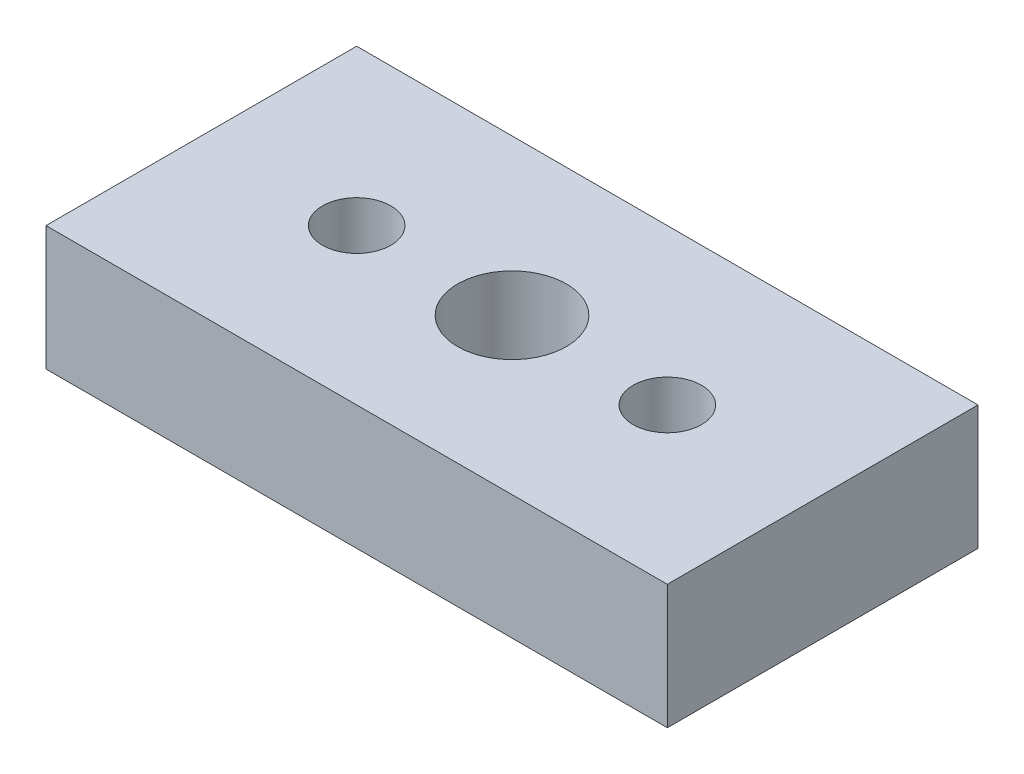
from build123d import *

# Parameters (mm, degrees)
SKETCH_1_W                = 60
SKETCH_1_H                = 30
EXTRUDE_1_DEPTH           = 12
M12X1_5_1_D               = 10.5
HOLE_WIZARD_1_D           = 6.6
HOLE_WIZARD_1_CBORE_D     = 11
HOLE_WIZARD_1_CBORE_DEPTH = 6.5


with BuildPart() as part:
    # Sketch 1 → Extrude 1 (new body)
    with BuildSketch(Plane(origin=(0, 0, 0), x_dir=(1, 0, 0), z_dir=(0, 1, 0))):
        Rectangle(SKETCH_1_W, SKETCH_1_H)
    extrude(amount=EXTRUDE_1_DEPTH)

    # M12x1.5 _1 (through all)
    with Locations(Plane.ZX.offset(12)):
        with Locations((0, 0)):
            Hole(M12X1_5_1_D / 2)

    # Hole Wizard 1 (through all)
    with Locations(Plane(origin=(-15, 0, 0), x_dir=(0, 0, -1), z_dir=(0, -1, 0))):
        with Locations((0, 0), (0, 30)):
            CounterBoreHole(HOLE_WIZARD_1_D / 2, HOLE_WIZARD_1_CBORE_D / 2, HOLE_WIZARD_1_CBORE_DEPTH)


solid = part.part
